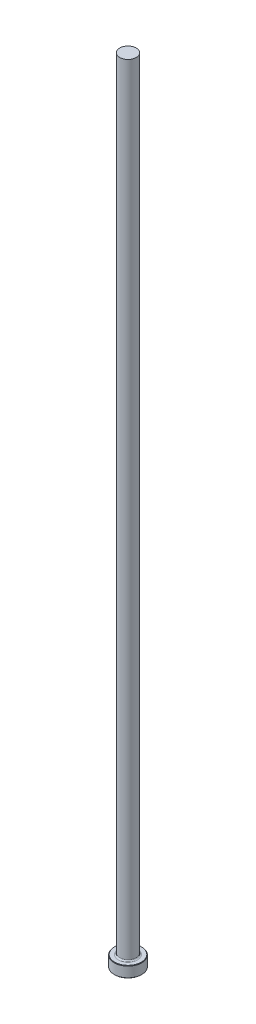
ISO-10303-21;
HEADER;
FILE_DESCRIPTION(('STEP AP214'),'2;1');
FILE_NAME('part.step','',(''),(''),'','','');
FILE_SCHEMA(('AUTOMOTIVE_DESIGN { 1 0 10303 214 1 1 1 1 }'));
ENDSEC;
DATA;
#1=APPLICATION_CONTEXT('core data for automotive mechanical design processes');
#2=APPLICATION_PROTOCOL_DEFINITION('international standard','automotive_design',2000,#1);
#3=PRODUCT_CONTEXT('',#1,'mechanical');
#4=PRODUCT('Part','Part','',(#3));
#5=PRODUCT_RELATED_PRODUCT_CATEGORY('part','',(#4));
#6=PRODUCT_DEFINITION_FORMATION('','',#4);
#7=PRODUCT_DEFINITION_CONTEXT('part definition',#1,'design');
#8=PRODUCT_DEFINITION('design','',#6,#7);
#9=PRODUCT_DEFINITION_SHAPE('','',#8);
#10=(LENGTH_UNIT() NAMED_UNIT(*) SI_UNIT(.MILLI.,.METRE.));
#11=(NAMED_UNIT(*) PLANE_ANGLE_UNIT() SI_UNIT($,.RADIAN.));
#12=(NAMED_UNIT(*) SI_UNIT($,.STERADIAN.) SOLID_ANGLE_UNIT());
#13=UNCERTAINTY_MEASURE_WITH_UNIT(LENGTH_MEASURE(1.E-05),#10,'distance_accuracy_value','');
#14=(GEOMETRIC_REPRESENTATION_CONTEXT(3) GLOBAL_UNCERTAINTY_ASSIGNED_CONTEXT((#13)) GLOBAL_UNIT_ASSIGNED_CONTEXT((#10,
#11,#12)) REPRESENTATION_CONTEXT('',''));
#15=CARTESIAN_POINT('',(0.,0.,0.));
#16=DIRECTION('',(0.,0.,1.));
#17=DIRECTION('',(1.,0.,0.));
#18=AXIS2_PLACEMENT_3D('',#15,#16,#17);
#19=CARTESIAN_POINT('',(0.,0.,0.));
#20=DIRECTION('',(0.,-1.,0.));
#21=DIRECTION('',(0.,0.,-1.));
#22=AXIS2_PLACEMENT_3D('',#19,#20,#21);
#23=PLANE('',#22);
#24=CARTESIAN_POINT('',(0.,0.,0.));
#25=DIRECTION('',(0.,-1.,0.));
#26=DIRECTION('',(0.,0.,-1.));
#27=AXIS2_PLACEMENT_3D('',#24,#25,#26);
#28=CIRCLE('',#27,7.68349999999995);
#29=CARTESIAN_POINT('',(0.,0.,-7.68349999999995));
#30=VERTEX_POINT('',#29);
#31=EDGE_CURVE('E46',#30,#30,#28,.T.);
#32=ORIENTED_EDGE('',*,*,#31,.T.);
#33=EDGE_LOOP('',(#32));
#34=FACE_BOUND('',#33,.T.);
#35=ADVANCED_FACE('F35',(#34),#23,.T.);
#36=CARTESIAN_POINT('',(0.,259.958771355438,0.));
#37=DIRECTION('',(0.,1.,0.));
#38=DIRECTION('',(0.,0.,1.));
#39=AXIS2_PLACEMENT_3D('',#36,#37,#38);
#40=CYLINDRICAL_SURFACE('',#39,7.93749999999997);
#41=CARTESIAN_POINT('',(0.,6.09599999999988,0.));
#42=DIRECTION('',(0.,1.,0.));
#43=DIRECTION('',(0.,0.,1.));
#44=AXIS2_PLACEMENT_3D('',#41,#42,#43);
#45=CIRCLE('',#44,7.93749999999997);
#46=CARTESIAN_POINT('',(0.,6.09599999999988,7.93749999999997));
#47=VERTEX_POINT('',#46);
#48=EDGE_CURVE('E50',#47,#47,#45,.F.);
#49=ORIENTED_EDGE('',*,*,#48,.T.);
#50=EDGE_LOOP('',(#49));
#51=FACE_BOUND('',#50,.T.);
#52=CARTESIAN_POINT('',(0.,0.254000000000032,0.));
#53=DIRECTION('',(0.,-1.,0.));
#54=DIRECTION('',(0.,0.,-1.));
#55=AXIS2_PLACEMENT_3D('',#52,#53,#54);
#56=CIRCLE('',#55,7.93749999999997);
#57=CARTESIAN_POINT('',(0.,0.254000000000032,-7.93749999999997));
#58=VERTEX_POINT('',#57);
#59=EDGE_CURVE('E55',#58,#58,#56,.F.);
#60=ORIENTED_EDGE('',*,*,#59,.T.);
#61=EDGE_LOOP('',(#60));
#62=FACE_BOUND('',#61,.T.);
#63=ADVANCED_FACE('F77',(#51,#62),#40,.T.);
#64=CARTESIAN_POINT('',(-7.93749999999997,6.35,0.));
#65=DIRECTION('',(0.,1.,0.));
#66=DIRECTION('',(0.,0.,1.));
#67=AXIS2_PLACEMENT_3D('',#64,#65,#66);
#68=PLANE('',#67);
#69=CARTESIAN_POINT('',(0.,6.35,0.));
#70=DIRECTION('',(0.,1.,0.));
#71=DIRECTION('',(0.,0.,1.));
#72=AXIS2_PLACEMENT_3D('',#69,#70,#71);
#73=CIRCLE('',#72,5.52449999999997);
#74=CARTESIAN_POINT('',(0.,6.35,5.52449999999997));
#75=VERTEX_POINT('',#74);
#76=EDGE_CURVE('E10',#75,#75,#73,.F.);
#77=ORIENTED_EDGE('',*,*,#76,.T.);
#78=EDGE_LOOP('',(#77));
#79=FACE_BOUND('',#78,.T.);
#80=CARTESIAN_POINT('',(0.,6.35,0.));
#81=DIRECTION('',(0.,1.,0.));
#82=DIRECTION('',(0.,0.,1.));
#83=AXIS2_PLACEMENT_3D('',#80,#81,#82);
#84=CIRCLE('',#83,7.68349999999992);
#85=CARTESIAN_POINT('',(0.,6.35,7.68349999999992));
#86=VERTEX_POINT('',#85);
#87=EDGE_CURVE('E58',#86,#86,#84,.T.);
#88=ORIENTED_EDGE('',*,*,#87,.T.);
#89=EDGE_LOOP('',(#88));
#90=FACE_BOUND('',#89,.T.);
#91=ADVANCED_FACE('F69',(#79,#90),#68,.T.);
#92=CARTESIAN_POINT('',(0.,259.958771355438,0.));
#93=DIRECTION('',(0.,1.,0.));
#94=DIRECTION('',(0.,0.,1.));
#95=AXIS2_PLACEMENT_3D('',#92,#93,#94);
#96=CYLINDRICAL_SURFACE('',#95,4.76249999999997);
#97=CARTESIAN_POINT('',(0.,7.11200000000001,0.));
#98=DIRECTION('',(0.,1.,0.));
#99=DIRECTION('',(0.,0.,1.));
#100=AXIS2_PLACEMENT_3D('',#97,#98,#99);
#101=CIRCLE('',#100,4.76249999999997);
#102=CARTESIAN_POINT('',(0.,7.11200000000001,4.76249999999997));
#103=VERTEX_POINT('',#102);
#104=EDGE_CURVE('E42',#103,#103,#101,.T.);
#105=ORIENTED_EDGE('',*,*,#104,.T.);
#106=EDGE_LOOP('',(#105));
#107=FACE_BOUND('',#106,.T.);
#108=CARTESIAN_POINT('',(0.,457.2,0.));
#109=DIRECTION('',(0.,1.,0.));
#110=DIRECTION('',(0.,0.,1.));
#111=AXIS2_PLACEMENT_3D('',#108,#109,#110);
#112=CIRCLE('',#111,4.76249999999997);
#113=CARTESIAN_POINT('',(0.,457.2,4.76249999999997));
#114=VERTEX_POINT('',#113);
#115=EDGE_CURVE('E61',#114,#114,#112,.T.);
#116=ORIENTED_EDGE('',*,*,#115,.F.);
#117=EDGE_LOOP('',(#116));
#118=FACE_BOUND('',#117,.T.);
#119=ADVANCED_FACE('F67',(#107,#118),#96,.T.);
#120=CARTESIAN_POINT('',(-4.76249999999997,457.2,0.));
#121=DIRECTION('',(0.,1.,0.));
#122=DIRECTION('',(0.,0.,1.));
#123=AXIS2_PLACEMENT_3D('',#120,#121,#122);
#124=PLANE('',#123);
#125=ORIENTED_EDGE('',*,*,#115,.T.);
#126=EDGE_LOOP('',(#125));
#127=FACE_BOUND('',#126,.T.);
#128=ADVANCED_FACE('F65',(#127),#124,.T.);
#129=CARTESIAN_POINT('',(0.,6.35000000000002,0.));
#130=DIRECTION('',(0.,-1.,0.));
#131=DIRECTION('',(0.,0.,-1.));
#132=AXIS2_PLACEMENT_3D('',#129,#130,#131);
#133=CONICAL_SURFACE('',#132,7.6834999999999,0.785398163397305);
#134=ORIENTED_EDGE('',*,*,#48,.F.);
#135=EDGE_LOOP('',(#134));
#136=FACE_BOUND('',#135,.T.);
#137=ORIENTED_EDGE('',*,*,#87,.F.);
#138=EDGE_LOOP('',(#137));
#139=FACE_BOUND('',#138,.T.);
#140=ADVANCED_FACE('F75',(#136,#139),#133,.T.);
#141=CARTESIAN_POINT('',(0.,0.254000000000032,0.));
#142=DIRECTION('',(0.,1.,0.));
#143=DIRECTION('',(0.,0.,1.));
#144=AXIS2_PLACEMENT_3D('',#141,#142,#143);
#145=CONICAL_SURFACE('',#144,7.93749999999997,0.785398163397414);
#146=ORIENTED_EDGE('',*,*,#31,.F.);
#147=EDGE_LOOP('',(#146));
#148=FACE_BOUND('',#147,.T.);
#149=ORIENTED_EDGE('',*,*,#59,.F.);
#150=EDGE_LOOP('',(#149));
#151=FACE_BOUND('',#150,.T.);
#152=ADVANCED_FACE('F89',(#148,#151),#145,.T.);
#153=CARTESIAN_POINT('',(0.,7.11200000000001,0.));
#154=DIRECTION('',(0.,1.,0.));
#155=DIRECTION('',(0.,0.,1.));
#156=AXIS2_PLACEMENT_3D('',#153,#154,#155);
#157=TOROIDAL_SURFACE('',#156,5.52449999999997,0.762);
#158=ORIENTED_EDGE('',*,*,#76,.F.);
#159=EDGE_LOOP('',(#158));
#160=FACE_BOUND('',#159,.T.);
#161=ORIENTED_EDGE('',*,*,#104,.F.);
#162=EDGE_LOOP('',(#161));
#163=FACE_BOUND('',#162,.T.);
#164=ADVANCED_FACE('F37',(#160,#163),#157,.F.);
#165=CLOSED_SHELL('',(#35,#63,#91,#119,#128,#140,#152,#164));
#166=MANIFOLD_SOLID_BREP('B2',#165);
#167=ADVANCED_BREP_SHAPE_REPRESENTATION('',(#18,#166),#14);
#168=SHAPE_DEFINITION_REPRESENTATION(#9,#167);
ENDSEC;
END-ISO-10303-21;
